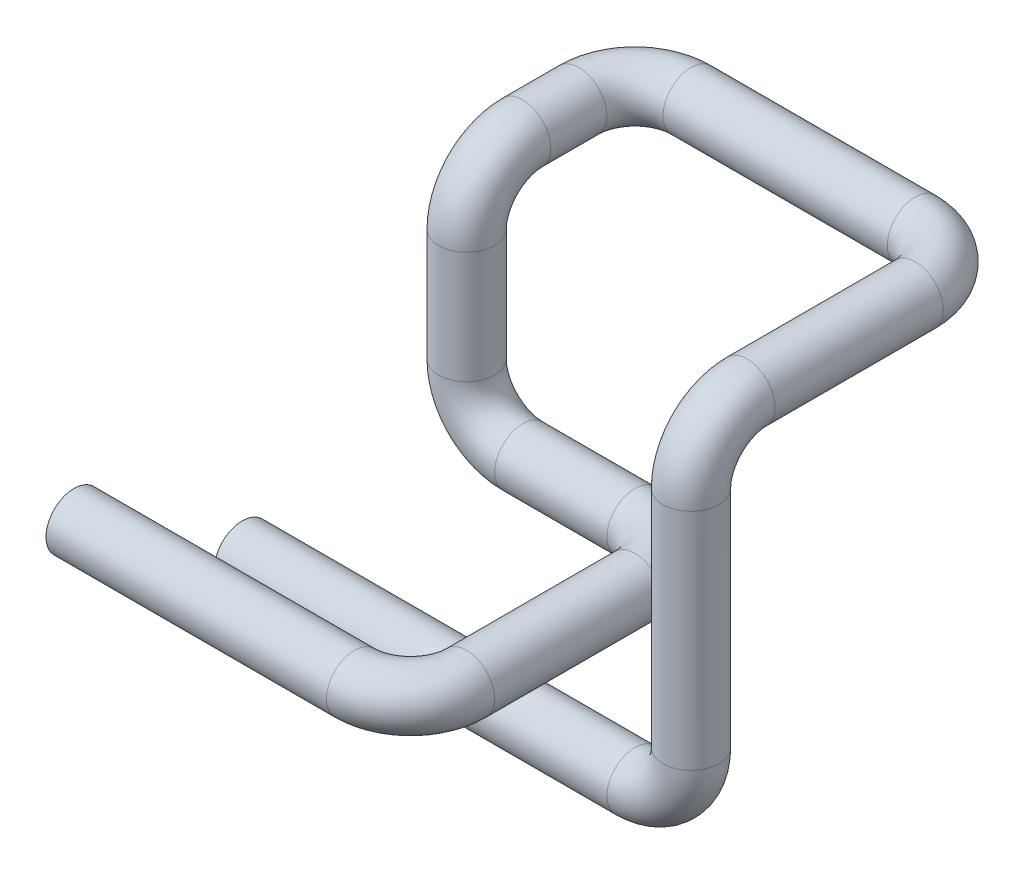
ISO-10303-21;
HEADER;
FILE_DESCRIPTION(('STEP AP214'),'2;1');
FILE_NAME('part.step','',(''),(''),'','','');
FILE_SCHEMA(('AUTOMOTIVE_DESIGN { 1 0 10303 214 1 1 1 1 }'));
ENDSEC;
DATA;
#1=APPLICATION_CONTEXT('core data for automotive mechanical design processes');
#2=APPLICATION_PROTOCOL_DEFINITION('international standard','automotive_design',2000,#1);
#3=PRODUCT_CONTEXT('',#1,'mechanical');
#4=PRODUCT('Part','Part','',(#3));
#5=PRODUCT_RELATED_PRODUCT_CATEGORY('part','',(#4));
#6=PRODUCT_DEFINITION_FORMATION('','',#4);
#7=PRODUCT_DEFINITION_CONTEXT('part definition',#1,'design');
#8=PRODUCT_DEFINITION('design','',#6,#7);
#9=PRODUCT_DEFINITION_SHAPE('','',#8);
#10=(LENGTH_UNIT() NAMED_UNIT(*) SI_UNIT(.MILLI.,.METRE.));
#11=(NAMED_UNIT(*) PLANE_ANGLE_UNIT() SI_UNIT($,.RADIAN.));
#12=(NAMED_UNIT(*) SI_UNIT($,.STERADIAN.) SOLID_ANGLE_UNIT());
#13=UNCERTAINTY_MEASURE_WITH_UNIT(LENGTH_MEASURE(1.E-05),#10,'distance_accuracy_value','');
#14=(GEOMETRIC_REPRESENTATION_CONTEXT(3) GLOBAL_UNCERTAINTY_ASSIGNED_CONTEXT((#13)) GLOBAL_UNIT_ASSIGNED_CONTEXT((#10,
#11,#12)) REPRESENTATION_CONTEXT('',''));
#15=CARTESIAN_POINT('',(0.,0.,0.));
#16=DIRECTION('',(0.,0.,1.));
#17=DIRECTION('',(1.,0.,0.));
#18=AXIS2_PLACEMENT_3D('',#15,#16,#17);
#19=CARTESIAN_POINT('',(0.,0.,0.));
#20=DIRECTION('',(-1.,0.,0.));
#21=DIRECTION('',(0.,0.,1.));
#22=AXIS2_PLACEMENT_3D('',#19,#20,#21);
#23=PLANE('',#22);
#24=CARTESIAN_POINT('',(0.,0.,0.));
#25=DIRECTION('',(-1.,0.,0.));
#26=DIRECTION('',(0.,-1.,0.));
#27=AXIS2_PLACEMENT_3D('',#24,#25,#26);
#28=CIRCLE('',#27,5.08);
#29=CARTESIAN_POINT('',(0.,-5.08,0.));
#30=VERTEX_POINT('',#29);
#31=EDGE_CURVE('E121',#30,#30,#28,.T.);
#32=ORIENTED_EDGE('',*,*,#31,.F.);
#33=EDGE_LOOP('',(#32));
#34=FACE_BOUND('',#33,.T.);
#35=CARTESIAN_POINT('',(0.,0.,0.));
#36=DIRECTION('',(-1.,0.,0.));
#37=DIRECTION('',(0.,0.,1.));
#38=AXIS2_PLACEMENT_3D('',#35,#36,#37);
#39=CIRCLE('',#38,6.35);
#40=CARTESIAN_POINT('',(0.,0.,6.35));
#41=VERTEX_POINT('',#40);
#42=EDGE_CURVE('E114',#41,#41,#39,.T.);
#43=ORIENTED_EDGE('',*,*,#42,.T.);
#44=EDGE_LOOP('',(#43));
#45=FACE_BOUND('',#44,.T.);
#46=ADVANCED_FACE('F56',(#34,#45),#23,.T.);
#47=CARTESIAN_POINT('',(0.,25.4,38.1));
#48=DIRECTION('',(1.,0.,0.));
#49=DIRECTION('',(0.,0.,-1.));
#50=AXIS2_PLACEMENT_3D('',#47,#48,#49);
#51=PLANE('',#50);
#52=CARTESIAN_POINT('',(0.,25.4,38.1));
#53=DIRECTION('',(1.,0.,0.));
#54=DIRECTION('',(0.,0.,-1.));
#55=AXIS2_PLACEMENT_3D('',#52,#53,#54);
#56=CIRCLE('',#55,5.08);
#57=CARTESIAN_POINT('',(0.,25.4,33.02));
#58=VERTEX_POINT('',#57);
#59=EDGE_CURVE('E117',#58,#58,#56,.T.);
#60=ORIENTED_EDGE('',*,*,#59,.T.);
#61=EDGE_LOOP('',(#60));
#62=FACE_BOUND('',#61,.T.);
#63=CARTESIAN_POINT('',(0.,25.4,38.1));
#64=DIRECTION('',(1.,0.,0.));
#65=DIRECTION('',(0.,0.,-1.));
#66=AXIS2_PLACEMENT_3D('',#63,#64,#65);
#67=CIRCLE('',#66,6.35);
#68=CARTESIAN_POINT('',(0.,25.4,31.75));
#69=VERTEX_POINT('',#68);
#70=EDGE_CURVE('E13',#69,#69,#67,.T.);
#71=ORIENTED_EDGE('',*,*,#70,.F.);
#72=EDGE_LOOP('',(#71));
#73=FACE_BOUND('',#72,.T.);
#74=ADVANCED_FACE('F183',(#62,#73),#51,.F.);
#75=CARTESIAN_POINT('',(0.,0.,0.));
#76=DIRECTION('',(1.,0.,0.));
#77=DIRECTION('',(0.,0.,-1.));
#78=AXIS2_PLACEMENT_3D('',#75,#76,#77);
#79=CYLINDRICAL_SURFACE('',#78,6.35);
#80=CARTESIAN_POINT('',(88.9,0.,0.));
#81=DIRECTION('',(-1.,0.,0.));
#82=DIRECTION('',(0.,0.,1.));
#83=AXIS2_PLACEMENT_3D('',#80,#81,#82);
#84=CIRCLE('',#83,6.35);
#85=CARTESIAN_POINT('',(88.9,-6.35000000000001,0.));
#86=VERTEX_POINT('',#85);
#87=EDGE_CURVE('E111',#86,#86,#84,.T.);
#88=ORIENTED_EDGE('',*,*,#87,.T.);
#89=EDGE_LOOP('',(#88));
#90=FACE_BOUND('',#89,.T.);
#91=ORIENTED_EDGE('',*,*,#42,.F.);
#92=EDGE_LOOP('',(#91));
#93=FACE_BOUND('',#92,.T.);
#94=ADVANCED_FACE('F187',(#90,#93),#79,.T.);
#95=CARTESIAN_POINT('',(88.9,12.7,0.));
#96=DIRECTION('',(0.,0.,1.));
#97=DIRECTION('',(1.,0.,0.));
#98=AXIS2_PLACEMENT_3D('',#95,#96,#97);
#99=TOROIDAL_SURFACE('',#98,12.7,6.35);
#100=CARTESIAN_POINT('',(101.6,12.7,0.));
#101=DIRECTION('',(0.,-1.,0.));
#102=DIRECTION('',(0.,0.,1.));
#103=AXIS2_PLACEMENT_3D('',#100,#101,#102);
#104=CIRCLE('',#103,6.35);
#105=CARTESIAN_POINT('',(107.95,12.7,0.));
#106=VERTEX_POINT('',#105);
#107=EDGE_CURVE('E108',#106,#106,#104,.T.);
#108=CARTESIAN_POINT('',(88.9,12.7,0.));
#109=DIRECTION('',(0.,0.,1.));
#110=DIRECTION('',(1.,0.,0.));
#111=AXIS2_PLACEMENT_3D('',#108,#109,#110);
#112=CIRCLE('',#111,19.05);
#113=EDGE_CURVE('',#86,#106,#112,.T.);
#114=ORIENTED_EDGE('',*,*,#87,.F.);
#115=ORIENTED_EDGE('',*,*,#107,.T.);
#116=ORIENTED_EDGE('',*,*,#113,.T.);
#117=ORIENTED_EDGE('',*,*,#113,.F.);
#118=EDGE_LOOP('',(#114,#116,#115,#117));
#119=FACE_BOUND('',#118,.T.);
#120=ADVANCED_FACE('F189',(#119),#99,.T.);
#121=CARTESIAN_POINT('',(101.6,12.7,0.));
#122=DIRECTION('',(0.,1.,0.));
#123=DIRECTION('',(0.,0.,1.));
#124=AXIS2_PLACEMENT_3D('',#121,#122,#123);
#125=CYLINDRICAL_SURFACE('',#124,6.35);
#126=CARTESIAN_POINT('',(101.6,63.5,0.));
#127=DIRECTION('',(0.,-1.,0.));
#128=DIRECTION('',(0.,0.,1.));
#129=AXIS2_PLACEMENT_3D('',#126,#127,#128);
#130=CIRCLE('',#129,6.35);
#131=CARTESIAN_POINT('',(101.6,63.5,6.35));
#132=VERTEX_POINT('',#131);
#133=EDGE_CURVE('E105',#132,#132,#130,.T.);
#134=ORIENTED_EDGE('',*,*,#133,.T.);
#135=EDGE_LOOP('',(#134));
#136=FACE_BOUND('',#135,.T.);
#137=ORIENTED_EDGE('',*,*,#107,.F.);
#138=EDGE_LOOP('',(#137));
#139=FACE_BOUND('',#138,.T.);
#140=ADVANCED_FACE('F196',(#136,#139),#125,.T.);
#141=CARTESIAN_POINT('',(101.6,63.5,-12.7));
#142=DIRECTION('',(-1.,0.,0.));
#143=DIRECTION('',(0.,0.,1.));
#144=AXIS2_PLACEMENT_3D('',#141,#142,#143);
#145=TOROIDAL_SURFACE('',#144,12.7,6.35);
#146=CARTESIAN_POINT('',(101.6,76.2,-12.7));
#147=DIRECTION('',(0.,0.,1.));
#148=DIRECTION('',(0.,1.,0.));
#149=AXIS2_PLACEMENT_3D('',#146,#147,#148);
#150=CIRCLE('',#149,6.35);
#151=CARTESIAN_POINT('',(101.6,82.55,-12.7));
#152=VERTEX_POINT('',#151);
#153=EDGE_CURVE('E102',#152,#152,#150,.T.);
#154=CARTESIAN_POINT('',(101.6,63.5,-12.7));
#155=DIRECTION('',(-1.,0.,0.));
#156=DIRECTION('',(0.,0.,1.));
#157=AXIS2_PLACEMENT_3D('',#154,#155,#156);
#158=CIRCLE('',#157,19.05);
#159=EDGE_CURVE('',#132,#152,#158,.T.);
#160=ORIENTED_EDGE('',*,*,#133,.F.);
#161=ORIENTED_EDGE('',*,*,#153,.T.);
#162=ORIENTED_EDGE('',*,*,#159,.T.);
#163=ORIENTED_EDGE('',*,*,#159,.F.);
#164=EDGE_LOOP('',(#160,#162,#161,#163));
#165=FACE_BOUND('',#164,.T.);
#166=ADVANCED_FACE('F253',(#165),#145,.T.);
#167=CARTESIAN_POINT('',(101.6,76.2,-12.7));
#168=DIRECTION('',(0.,0.,-1.));
#169=DIRECTION('',(-1.,0.,0.));
#170=AXIS2_PLACEMENT_3D('',#167,#168,#169);
#171=CYLINDRICAL_SURFACE('',#170,6.35);
#172=CARTESIAN_POINT('',(101.6,76.2,-50.8));
#173=DIRECTION('',(0.,0.,1.));
#174=DIRECTION('',(0.,1.,0.));
#175=AXIS2_PLACEMENT_3D('',#172,#173,#174);
#176=CIRCLE('',#175,6.35);
#177=CARTESIAN_POINT('',(107.95,76.2,-50.8));
#178=VERTEX_POINT('',#177);
#179=EDGE_CURVE('E99',#178,#178,#176,.T.);
#180=ORIENTED_EDGE('',*,*,#179,.T.);
#181=EDGE_LOOP('',(#180));
#182=FACE_BOUND('',#181,.T.);
#183=ORIENTED_EDGE('',*,*,#153,.F.);
#184=EDGE_LOOP('',(#183));
#185=FACE_BOUND('',#184,.T.);
#186=ADVANCED_FACE('F249',(#182,#185),#171,.T.);
#187=CARTESIAN_POINT('',(88.9,76.2,-50.8));
#188=DIRECTION('',(0.,1.,0.));
#189=DIRECTION('',(0.,0.,1.));
#190=AXIS2_PLACEMENT_3D('',#187,#188,#189);
#191=TOROIDAL_SURFACE('',#190,12.7,6.35);
#192=CARTESIAN_POINT('',(88.9,76.2,-63.5));
#193=DIRECTION('',(1.,0.,0.));
#194=DIRECTION('',(0.,1.,0.));
#195=AXIS2_PLACEMENT_3D('',#192,#193,#194);
#196=CIRCLE('',#195,6.35);
#197=CARTESIAN_POINT('',(88.9,76.2,-69.85));
#198=VERTEX_POINT('',#197);
#199=EDGE_CURVE('E96',#198,#198,#196,.T.);
#200=CARTESIAN_POINT('',(88.9,76.2,-50.8));
#201=DIRECTION('',(0.,1.,0.));
#202=DIRECTION('',(0.,0.,1.));
#203=AXIS2_PLACEMENT_3D('',#200,#201,#202);
#204=CIRCLE('',#203,19.05);
#205=EDGE_CURVE('',#178,#198,#204,.T.);
#206=ORIENTED_EDGE('',*,*,#179,.F.);
#207=ORIENTED_EDGE('',*,*,#199,.T.);
#208=ORIENTED_EDGE('',*,*,#205,.T.);
#209=ORIENTED_EDGE('',*,*,#205,.F.);
#210=EDGE_LOOP('',(#206,#208,#207,#209));
#211=FACE_BOUND('',#210,.T.);
#212=ADVANCED_FACE('F245',(#211),#191,.T.);
#213=CARTESIAN_POINT('',(88.9,76.2,-63.5));
#214=DIRECTION('',(-1.,0.,0.));
#215=DIRECTION('',(0.,0.,1.));
#216=AXIS2_PLACEMENT_3D('',#213,#214,#215);
#217=CYLINDRICAL_SURFACE('',#216,6.35);
#218=CARTESIAN_POINT('',(38.1,76.2,-63.5));
#219=DIRECTION('',(1.,0.,0.));
#220=DIRECTION('',(0.,1.,0.));
#221=AXIS2_PLACEMENT_3D('',#218,#219,#220);
#222=CIRCLE('',#221,6.35);
#223=CARTESIAN_POINT('',(38.1,76.2,-69.85));
#224=VERTEX_POINT('',#223);
#225=EDGE_CURVE('E93',#224,#224,#222,.T.);
#226=ORIENTED_EDGE('',*,*,#225,.T.);
#227=EDGE_LOOP('',(#226));
#228=FACE_BOUND('',#227,.T.);
#229=ORIENTED_EDGE('',*,*,#199,.F.);
#230=EDGE_LOOP('',(#229));
#231=FACE_BOUND('',#230,.T.);
#232=ADVANCED_FACE('F241',(#228,#231),#217,.T.);
#233=CARTESIAN_POINT('',(38.1,76.2,-50.8));
#234=DIRECTION('',(0.,1.,0.));
#235=DIRECTION('',(0.,0.,1.));
#236=AXIS2_PLACEMENT_3D('',#233,#234,#235);
#237=TOROIDAL_SURFACE('',#236,12.7,6.35);
#238=CARTESIAN_POINT('',(25.4,76.2,-50.8));
#239=DIRECTION('',(0.,0.,-1.));
#240=DIRECTION('',(0.,1.,0.));
#241=AXIS2_PLACEMENT_3D('',#238,#239,#240);
#242=CIRCLE('',#241,6.35);
#243=CARTESIAN_POINT('',(19.05,76.2,-50.8));
#244=VERTEX_POINT('',#243);
#245=EDGE_CURVE('E90',#244,#244,#242,.T.);
#246=CARTESIAN_POINT('',(38.1,76.2,-50.8));
#247=DIRECTION('',(0.,1.,0.));
#248=DIRECTION('',(0.,0.,1.));
#249=AXIS2_PLACEMENT_3D('',#246,#247,#248);
#250=CIRCLE('',#249,19.05);
#251=EDGE_CURVE('',#224,#244,#250,.T.);
#252=ORIENTED_EDGE('',*,*,#225,.F.);
#253=ORIENTED_EDGE('',*,*,#245,.T.);
#254=ORIENTED_EDGE('',*,*,#251,.T.);
#255=ORIENTED_EDGE('',*,*,#251,.F.);
#256=EDGE_LOOP('',(#252,#254,#253,#255));
#257=FACE_BOUND('',#256,.T.);
#258=ADVANCED_FACE('F237',(#257),#237,.T.);
#259=CARTESIAN_POINT('',(25.4,76.2,-50.8));
#260=DIRECTION('',(0.,0.,1.));
#261=DIRECTION('',(1.,0.,0.));
#262=AXIS2_PLACEMENT_3D('',#259,#260,#261);
#263=CYLINDRICAL_SURFACE('',#262,6.35);
#264=CARTESIAN_POINT('',(25.4,76.2,-38.1));
#265=DIRECTION('',(0.,0.,-1.));
#266=DIRECTION('',(0.,1.,0.));
#267=AXIS2_PLACEMENT_3D('',#264,#265,#266);
#268=CIRCLE('',#267,6.35);
#269=CARTESIAN_POINT('',(25.4,82.55,-38.1));
#270=VERTEX_POINT('',#269);
#271=EDGE_CURVE('E87',#270,#270,#268,.T.);
#272=ORIENTED_EDGE('',*,*,#271,.T.);
#273=EDGE_LOOP('',(#272));
#274=FACE_BOUND('',#273,.T.);
#275=ORIENTED_EDGE('',*,*,#245,.F.);
#276=EDGE_LOOP('',(#275));
#277=FACE_BOUND('',#276,.T.);
#278=ADVANCED_FACE('F233',(#274,#277),#263,.T.);
#279=CARTESIAN_POINT('',(25.4,63.5,-38.1));
#280=DIRECTION('',(1.,0.,0.));
#281=DIRECTION('',(0.,0.,-1.));
#282=AXIS2_PLACEMENT_3D('',#279,#280,#281);
#283=TOROIDAL_SURFACE('',#282,12.7,6.35);
#284=CARTESIAN_POINT('',(25.4,63.5,-25.4));
#285=DIRECTION('',(0.,1.,0.));
#286=DIRECTION('',(0.,0.,1.));
#287=AXIS2_PLACEMENT_3D('',#284,#285,#286);
#288=CIRCLE('',#287,6.35);
#289=CARTESIAN_POINT('',(25.4,63.5,-19.05));
#290=VERTEX_POINT('',#289);
#291=EDGE_CURVE('E84',#290,#290,#288,.T.);
#292=CARTESIAN_POINT('',(25.4,63.5,-38.1));
#293=DIRECTION('',(1.,0.,0.));
#294=DIRECTION('',(0.,0.,-1.));
#295=AXIS2_PLACEMENT_3D('',#292,#293,#294);
#296=CIRCLE('',#295,19.05);
#297=EDGE_CURVE('',#270,#290,#296,.T.);
#298=ORIENTED_EDGE('',*,*,#271,.F.);
#299=ORIENTED_EDGE('',*,*,#291,.T.);
#300=ORIENTED_EDGE('',*,*,#297,.T.);
#301=ORIENTED_EDGE('',*,*,#297,.F.);
#302=EDGE_LOOP('',(#298,#300,#299,#301));
#303=FACE_BOUND('',#302,.T.);
#304=ADVANCED_FACE('F229',(#303),#283,.T.);
#305=CARTESIAN_POINT('',(25.4,63.5,-25.4));
#306=DIRECTION('',(0.,-1.,0.));
#307=DIRECTION('',(1.,0.,0.));
#308=AXIS2_PLACEMENT_3D('',#305,#306,#307);
#309=CYLINDRICAL_SURFACE('',#308,6.35);
#310=CARTESIAN_POINT('',(25.4,38.1,-25.4));
#311=DIRECTION('',(0.,1.,0.));
#312=DIRECTION('',(0.,0.,1.));
#313=AXIS2_PLACEMENT_3D('',#310,#311,#312);
#314=CIRCLE('',#313,6.35);
#315=CARTESIAN_POINT('',(19.05,38.1,-25.4));
#316=VERTEX_POINT('',#315);
#317=EDGE_CURVE('E81',#316,#316,#314,.T.);
#318=ORIENTED_EDGE('',*,*,#317,.T.);
#319=EDGE_LOOP('',(#318));
#320=FACE_BOUND('',#319,.T.);
#321=ORIENTED_EDGE('',*,*,#291,.F.);
#322=EDGE_LOOP('',(#321));
#323=FACE_BOUND('',#322,.T.);
#324=ADVANCED_FACE('F225',(#320,#323),#309,.T.);
#325=CARTESIAN_POINT('',(38.1,38.1,-25.4));
#326=DIRECTION('',(0.,0.,1.));
#327=DIRECTION('',(1.,0.,0.));
#328=AXIS2_PLACEMENT_3D('',#325,#326,#327);
#329=TOROIDAL_SURFACE('',#328,12.7,6.35);
#330=CARTESIAN_POINT('',(38.1,25.4,-25.4));
#331=DIRECTION('',(-1.,0.,0.));
#332=DIRECTION('',(0.,0.,1.));
#333=AXIS2_PLACEMENT_3D('',#330,#331,#332);
#334=CIRCLE('',#333,6.35);
#335=CARTESIAN_POINT('',(38.1,19.05,-25.4));
#336=VERTEX_POINT('',#335);
#337=EDGE_CURVE('E78',#336,#336,#334,.T.);
#338=CARTESIAN_POINT('',(38.1,38.1,-25.4));
#339=DIRECTION('',(0.,0.,1.));
#340=DIRECTION('',(1.,0.,0.));
#341=AXIS2_PLACEMENT_3D('',#338,#339,#340);
#342=CIRCLE('',#341,19.05);
#343=EDGE_CURVE('',#316,#336,#342,.T.);
#344=ORIENTED_EDGE('',*,*,#317,.F.);
#345=ORIENTED_EDGE('',*,*,#337,.T.);
#346=ORIENTED_EDGE('',*,*,#343,.T.);
#347=ORIENTED_EDGE('',*,*,#343,.F.);
#348=EDGE_LOOP('',(#344,#346,#345,#347));
#349=FACE_BOUND('',#348,.T.);
#350=ADVANCED_FACE('F221',(#349),#329,.T.);
#351=CARTESIAN_POINT('',(38.1,25.4,-25.4));
#352=DIRECTION('',(1.,0.,0.));
#353=DIRECTION('',(0.,0.,-1.));
#354=AXIS2_PLACEMENT_3D('',#351,#352,#353);
#355=CYLINDRICAL_SURFACE('',#354,6.35);
#356=CARTESIAN_POINT('',(63.5,25.4,-25.4));
#357=DIRECTION('',(-1.,0.,0.));
#358=DIRECTION('',(0.,0.,1.));
#359=AXIS2_PLACEMENT_3D('',#356,#357,#358);
#360=CIRCLE('',#359,6.35);
#361=CARTESIAN_POINT('',(63.5,25.4,-31.75));
#362=VERTEX_POINT('',#361);
#363=EDGE_CURVE('E75',#362,#362,#360,.T.);
#364=ORIENTED_EDGE('',*,*,#363,.T.);
#365=EDGE_LOOP('',(#364));
#366=FACE_BOUND('',#365,.T.);
#367=ORIENTED_EDGE('',*,*,#337,.F.);
#368=EDGE_LOOP('',(#367));
#369=FACE_BOUND('',#368,.T.);
#370=ADVANCED_FACE('F217',(#366,#369),#355,.T.);
#371=CARTESIAN_POINT('',(63.5,25.4,-12.7));
#372=DIRECTION('',(0.,-1.,0.));
#373=DIRECTION('',(0.,0.,-1.));
#374=AXIS2_PLACEMENT_3D('',#371,#372,#373);
#375=TOROIDAL_SURFACE('',#374,12.7,6.35);
#376=CARTESIAN_POINT('',(76.2,25.4,-12.7));
#377=DIRECTION('',(0.,0.,-1.));
#378=DIRECTION('',(-1.,0.,0.));
#379=AXIS2_PLACEMENT_3D('',#376,#377,#378);
#380=CIRCLE('',#379,6.35);
#381=CARTESIAN_POINT('',(82.55,25.4,-12.7));
#382=VERTEX_POINT('',#381);
#383=EDGE_CURVE('E70',#382,#382,#380,.T.);
#384=CARTESIAN_POINT('',(63.5,25.4,-12.7));
#385=DIRECTION('',(0.,-1.,0.));
#386=DIRECTION('',(0.,0.,-1.));
#387=AXIS2_PLACEMENT_3D('',#384,#385,#386);
#388=CIRCLE('',#387,19.05);
#389=EDGE_CURVE('',#362,#382,#388,.T.);
#390=ORIENTED_EDGE('',*,*,#363,.F.);
#391=ORIENTED_EDGE('',*,*,#383,.T.);
#392=ORIENTED_EDGE('',*,*,#389,.T.);
#393=ORIENTED_EDGE('',*,*,#389,.F.);
#394=EDGE_LOOP('',(#390,#392,#391,#393));
#395=FACE_BOUND('',#394,.T.);
#396=ADVANCED_FACE('F213',(#395),#375,.T.);
#397=CARTESIAN_POINT('',(76.2,25.4,-12.7));
#398=DIRECTION('',(0.,0.,1.));
#399=DIRECTION('',(1.,0.,0.));
#400=AXIS2_PLACEMENT_3D('',#397,#398,#399);
#401=CYLINDRICAL_SURFACE('',#400,6.35);
#402=CARTESIAN_POINT('',(76.2,25.4,25.4));
#403=DIRECTION('',(0.,0.,-1.));
#404=DIRECTION('',(-1.,0.,0.));
#405=AXIS2_PLACEMENT_3D('',#402,#403,#404);
#406=CIRCLE('',#405,6.35);
#407=CARTESIAN_POINT('',(82.55,25.4,25.4));
#408=VERTEX_POINT('',#407);
#409=EDGE_CURVE('E66',#408,#408,#406,.T.);
#410=ORIENTED_EDGE('',*,*,#409,.T.);
#411=EDGE_LOOP('',(#410));
#412=FACE_BOUND('',#411,.T.);
#413=ORIENTED_EDGE('',*,*,#383,.F.);
#414=EDGE_LOOP('',(#413));
#415=FACE_BOUND('',#414,.T.);
#416=ADVANCED_FACE('F207',(#412,#415),#401,.T.);
#417=CARTESIAN_POINT('',(63.5,25.4,25.4));
#418=DIRECTION('',(0.,-1.,0.));
#419=DIRECTION('',(0.,0.,-1.));
#420=AXIS2_PLACEMENT_3D('',#417,#418,#419);
#421=TOROIDAL_SURFACE('',#420,12.7,6.35);
#422=CARTESIAN_POINT('',(63.5,25.4,38.1));
#423=DIRECTION('',(1.,0.,0.));
#424=DIRECTION('',(0.,0.,-1.));
#425=AXIS2_PLACEMENT_3D('',#422,#423,#424);
#426=CIRCLE('',#425,6.35);
#427=CARTESIAN_POINT('',(63.5,25.4,44.45));
#428=VERTEX_POINT('',#427);
#429=EDGE_CURVE('E62',#428,#428,#426,.T.);
#430=CARTESIAN_POINT('',(63.5,25.4,25.4));
#431=DIRECTION('',(0.,-1.,0.));
#432=DIRECTION('',(0.,0.,-1.));
#433=AXIS2_PLACEMENT_3D('',#430,#431,#432);
#434=CIRCLE('',#433,19.05);
#435=EDGE_CURVE('',#408,#428,#434,.T.);
#436=ORIENTED_EDGE('',*,*,#409,.F.);
#437=ORIENTED_EDGE('',*,*,#429,.T.);
#438=ORIENTED_EDGE('',*,*,#435,.T.);
#439=ORIENTED_EDGE('',*,*,#435,.F.);
#440=EDGE_LOOP('',(#436,#438,#437,#439));
#441=FACE_BOUND('',#440,.T.);
#442=ADVANCED_FACE('F202',(#441),#421,.T.);
#443=CARTESIAN_POINT('',(63.5,25.4,38.1));
#444=DIRECTION('',(-1.,0.,0.));
#445=DIRECTION('',(0.,-1.,0.));
#446=AXIS2_PLACEMENT_3D('',#443,#444,#445);
#447=CYLINDRICAL_SURFACE('',#446,6.35);
#448=ORIENTED_EDGE('',*,*,#70,.T.);
#449=EDGE_LOOP('',(#448));
#450=FACE_BOUND('',#449,.T.);
#451=ORIENTED_EDGE('',*,*,#429,.F.);
#452=EDGE_LOOP('',(#451));
#453=FACE_BOUND('',#452,.T.);
#454=ADVANCED_FACE('F177',(#450,#453),#447,.T.);
#455=CARTESIAN_POINT('',(0.,0.,0.));
#456=DIRECTION('',(1.,0.,0.));
#457=DIRECTION('',(0.,0.,-1.));
#458=AXIS2_PLACEMENT_3D('',#455,#456,#457);
#459=CYLINDRICAL_SURFACE('',#458,5.08);
#460=CARTESIAN_POINT('',(88.9,0.,0.));
#461=DIRECTION('',(1.,0.,0.));
#462=DIRECTION('',(0.,0.,-1.));
#463=AXIS2_PLACEMENT_3D('',#460,#461,#462);
#464=CIRCLE('',#463,5.08);
#465=CARTESIAN_POINT('',(88.9,-5.08000000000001,0.));
#466=VERTEX_POINT('',#465);
#467=EDGE_CURVE('E124',#466,#466,#464,.F.);
#468=ORIENTED_EDGE('',*,*,#467,.F.);
#469=EDGE_LOOP('',(#468));
#470=FACE_BOUND('',#469,.T.);
#471=ORIENTED_EDGE('',*,*,#31,.T.);
#472=EDGE_LOOP('',(#471));
#473=FACE_BOUND('',#472,.T.);
#474=ADVANCED_FACE('F174',(#470,#473),#459,.F.);
#475=CARTESIAN_POINT('',(88.9,12.7,0.));
#476=DIRECTION('',(0.,0.,1.));
#477=DIRECTION('',(1.,0.,0.));
#478=AXIS2_PLACEMENT_3D('',#475,#476,#477);
#479=TOROIDAL_SURFACE('',#478,12.7,5.08);
#480=CARTESIAN_POINT('',(101.6,12.7,0.));
#481=DIRECTION('',(0.,-1.,0.));
#482=DIRECTION('',(0.,0.,-1.));
#483=AXIS2_PLACEMENT_3D('',#480,#481,#482);
#484=CIRCLE('',#483,5.08);
#485=CARTESIAN_POINT('',(106.68,12.7,0.));
#486=VERTEX_POINT('',#485);
#487=EDGE_CURVE('E166',#486,#486,#484,.T.);
#488=CARTESIAN_POINT('',(88.9,12.7,0.));
#489=DIRECTION('',(0.,0.,1.));
#490=DIRECTION('',(1.,0.,0.));
#491=AXIS2_PLACEMENT_3D('',#488,#489,#490);
#492=CIRCLE('',#491,17.78);
#493=EDGE_CURVE('',#466,#486,#492,.T.);
#494=ORIENTED_EDGE('',*,*,#467,.T.);
#495=ORIENTED_EDGE('',*,*,#487,.F.);
#496=ORIENTED_EDGE('',*,*,#493,.T.);
#497=ORIENTED_EDGE('',*,*,#493,.F.);
#498=EDGE_LOOP('',(#494,#496,#495,#497));
#499=FACE_BOUND('',#498,.T.);
#500=ADVANCED_FACE('F172',(#499),#479,.F.);
#501=CARTESIAN_POINT('',(101.6,12.7,0.));
#502=DIRECTION('',(0.,1.,0.));
#503=DIRECTION('',(0.,0.,1.));
#504=AXIS2_PLACEMENT_3D('',#501,#502,#503);
#505=CYLINDRICAL_SURFACE('',#504,5.08);
#506=CARTESIAN_POINT('',(101.6,63.5,0.));
#507=DIRECTION('',(0.,1.,0.));
#508=DIRECTION('',(0.,0.,1.));
#509=AXIS2_PLACEMENT_3D('',#506,#507,#508);
#510=CIRCLE('',#509,5.08);
#511=CARTESIAN_POINT('',(101.6,63.5,5.08));
#512=VERTEX_POINT('',#511);
#513=EDGE_CURVE('E163',#512,#512,#510,.F.);
#514=ORIENTED_EDGE('',*,*,#513,.F.);
#515=EDGE_LOOP('',(#514));
#516=FACE_BOUND('',#515,.T.);
#517=ORIENTED_EDGE('',*,*,#487,.T.);
#518=EDGE_LOOP('',(#517));
#519=FACE_BOUND('',#518,.T.);
#520=ADVANCED_FACE('F341',(#516,#519),#505,.F.);
#521=CARTESIAN_POINT('',(101.6,63.5,-12.7));
#522=DIRECTION('',(-1.,0.,0.));
#523=DIRECTION('',(0.,0.,1.));
#524=AXIS2_PLACEMENT_3D('',#521,#522,#523);
#525=TOROIDAL_SURFACE('',#524,12.7,5.08);
#526=CARTESIAN_POINT('',(101.6,76.2,-12.7));
#527=DIRECTION('',(0.,0.,1.));
#528=DIRECTION('',(0.,-1.,0.));
#529=AXIS2_PLACEMENT_3D('',#526,#527,#528);
#530=CIRCLE('',#529,5.08);
#531=CARTESIAN_POINT('',(101.6,81.28,-12.7));
#532=VERTEX_POINT('',#531);
#533=EDGE_CURVE('E160',#532,#532,#530,.T.);
#534=CARTESIAN_POINT('',(101.6,63.5,-12.7));
#535=DIRECTION('',(-1.,0.,0.));
#536=DIRECTION('',(0.,0.,1.));
#537=AXIS2_PLACEMENT_3D('',#534,#535,#536);
#538=CIRCLE('',#537,17.78);
#539=EDGE_CURVE('',#512,#532,#538,.T.);
#540=ORIENTED_EDGE('',*,*,#513,.T.);
#541=ORIENTED_EDGE('',*,*,#533,.F.);
#542=ORIENTED_EDGE('',*,*,#539,.T.);
#543=ORIENTED_EDGE('',*,*,#539,.F.);
#544=EDGE_LOOP('',(#540,#542,#541,#543));
#545=FACE_BOUND('',#544,.T.);
#546=ADVANCED_FACE('F351',(#545),#525,.F.);
#547=CARTESIAN_POINT('',(101.6,76.2,-12.7));
#548=DIRECTION('',(0.,0.,-1.));
#549=DIRECTION('',(-1.,0.,0.));
#550=AXIS2_PLACEMENT_3D('',#547,#548,#549);
#551=CYLINDRICAL_SURFACE('',#550,5.08);
#552=CARTESIAN_POINT('',(101.6,76.2,-50.8));
#553=DIRECTION('',(0.,0.,-1.));
#554=DIRECTION('',(-1.,0.,0.));
#555=AXIS2_PLACEMENT_3D('',#552,#553,#554);
#556=CIRCLE('',#555,5.08);
#557=CARTESIAN_POINT('',(106.68,76.2,-50.8));
#558=VERTEX_POINT('',#557);
#559=EDGE_CURVE('E157',#558,#558,#556,.F.);
#560=ORIENTED_EDGE('',*,*,#559,.F.);
#561=EDGE_LOOP('',(#560));
#562=FACE_BOUND('',#561,.T.);
#563=ORIENTED_EDGE('',*,*,#533,.T.);
#564=EDGE_LOOP('',(#563));
#565=FACE_BOUND('',#564,.T.);
#566=ADVANCED_FACE('F361',(#562,#565),#551,.F.);
#567=CARTESIAN_POINT('',(88.9,76.2,-50.8));
#568=DIRECTION('',(0.,1.,0.));
#569=DIRECTION('',(0.,0.,1.));
#570=AXIS2_PLACEMENT_3D('',#567,#568,#569);
#571=TOROIDAL_SURFACE('',#570,12.7,5.08);
#572=CARTESIAN_POINT('',(88.9,76.2,-63.5));
#573=DIRECTION('',(1.,0.,0.));
#574=DIRECTION('',(0.,0.,-1.));
#575=AXIS2_PLACEMENT_3D('',#572,#573,#574);
#576=CIRCLE('',#575,5.08);
#577=CARTESIAN_POINT('',(88.9,76.2,-68.58));
#578=VERTEX_POINT('',#577);
#579=EDGE_CURVE('E154',#578,#578,#576,.T.);
#580=CARTESIAN_POINT('',(88.9,76.2,-50.8));
#581=DIRECTION('',(0.,1.,0.));
#582=DIRECTION('',(0.,0.,1.));
#583=AXIS2_PLACEMENT_3D('',#580,#581,#582);
#584=CIRCLE('',#583,17.78);
#585=EDGE_CURVE('',#558,#578,#584,.T.);
#586=ORIENTED_EDGE('',*,*,#559,.T.);
#587=ORIENTED_EDGE('',*,*,#579,.F.);
#588=ORIENTED_EDGE('',*,*,#585,.T.);
#589=ORIENTED_EDGE('',*,*,#585,.F.);
#590=EDGE_LOOP('',(#586,#588,#587,#589));
#591=FACE_BOUND('',#590,.T.);
#592=ADVANCED_FACE('F371',(#591),#571,.F.);
#593=CARTESIAN_POINT('',(88.9,76.2,-63.5));
#594=DIRECTION('',(-1.,0.,0.));
#595=DIRECTION('',(0.,0.,1.));
#596=AXIS2_PLACEMENT_3D('',#593,#594,#595);
#597=CYLINDRICAL_SURFACE('',#596,5.08);
#598=CARTESIAN_POINT('',(38.1,76.2,-63.5));
#599=DIRECTION('',(-1.,0.,0.));
#600=DIRECTION('',(0.,0.,1.));
#601=AXIS2_PLACEMENT_3D('',#598,#599,#600);
#602=CIRCLE('',#601,5.08);
#603=CARTESIAN_POINT('',(38.1,76.2,-68.58));
#604=VERTEX_POINT('',#603);
#605=EDGE_CURVE('E151',#604,#604,#602,.F.);
#606=ORIENTED_EDGE('',*,*,#605,.F.);
#607=EDGE_LOOP('',(#606));
#608=FACE_BOUND('',#607,.T.);
#609=ORIENTED_EDGE('',*,*,#579,.T.);
#610=EDGE_LOOP('',(#609));
#611=FACE_BOUND('',#610,.T.);
#612=ADVANCED_FACE('F381',(#608,#611),#597,.F.);
#613=CARTESIAN_POINT('',(38.1,76.2,-50.8));
#614=DIRECTION('',(0.,1.,0.));
#615=DIRECTION('',(0.,0.,1.));
#616=AXIS2_PLACEMENT_3D('',#613,#614,#615);
#617=TOROIDAL_SURFACE('',#616,12.7,5.08);
#618=CARTESIAN_POINT('',(25.4,76.2,-50.8));
#619=DIRECTION('',(0.,0.,-1.));
#620=DIRECTION('',(-1.,0.,0.));
#621=AXIS2_PLACEMENT_3D('',#618,#619,#620);
#622=CIRCLE('',#621,5.08);
#623=CARTESIAN_POINT('',(20.32,76.2,-50.8));
#624=VERTEX_POINT('',#623);
#625=EDGE_CURVE('E148',#624,#624,#622,.T.);
#626=CARTESIAN_POINT('',(38.1,76.2,-50.8));
#627=DIRECTION('',(0.,1.,0.));
#628=DIRECTION('',(0.,0.,1.));
#629=AXIS2_PLACEMENT_3D('',#626,#627,#628);
#630=CIRCLE('',#629,17.78);
#631=EDGE_CURVE('',#604,#624,#630,.T.);
#632=ORIENTED_EDGE('',*,*,#605,.T.);
#633=ORIENTED_EDGE('',*,*,#625,.F.);
#634=ORIENTED_EDGE('',*,*,#631,.T.);
#635=ORIENTED_EDGE('',*,*,#631,.F.);
#636=EDGE_LOOP('',(#632,#634,#633,#635));
#637=FACE_BOUND('',#636,.T.);
#638=ADVANCED_FACE('F391',(#637),#617,.F.);
#639=CARTESIAN_POINT('',(25.4,76.2,-50.8));
#640=DIRECTION('',(0.,0.,1.));
#641=DIRECTION('',(1.,0.,0.));
#642=AXIS2_PLACEMENT_3D('',#639,#640,#641);
#643=CYLINDRICAL_SURFACE('',#642,5.08);
#644=CARTESIAN_POINT('',(25.4,76.2,-38.1));
#645=DIRECTION('',(0.,0.,1.));
#646=DIRECTION('',(1.,0.,0.));
#647=AXIS2_PLACEMENT_3D('',#644,#645,#646);
#648=CIRCLE('',#647,5.08);
#649=CARTESIAN_POINT('',(25.4,81.28,-38.1));
#650=VERTEX_POINT('',#649);
#651=EDGE_CURVE('E145',#650,#650,#648,.F.);
#652=ORIENTED_EDGE('',*,*,#651,.F.);
#653=EDGE_LOOP('',(#652));
#654=FACE_BOUND('',#653,.T.);
#655=ORIENTED_EDGE('',*,*,#625,.T.);
#656=EDGE_LOOP('',(#655));
#657=FACE_BOUND('',#656,.T.);
#658=ADVANCED_FACE('F401',(#654,#657),#643,.F.);
#659=CARTESIAN_POINT('',(25.4,63.5,-38.1));
#660=DIRECTION('',(1.,0.,0.));
#661=DIRECTION('',(0.,0.,-1.));
#662=AXIS2_PLACEMENT_3D('',#659,#660,#661);
#663=TOROIDAL_SURFACE('',#662,12.7,5.08);
#664=CARTESIAN_POINT('',(25.4,63.5,-25.4));
#665=DIRECTION('',(0.,1.,0.));
#666=DIRECTION('',(0.,0.,1.));
#667=AXIS2_PLACEMENT_3D('',#664,#665,#666);
#668=CIRCLE('',#667,5.08);
#669=CARTESIAN_POINT('',(25.4,63.5,-20.32));
#670=VERTEX_POINT('',#669);
#671=EDGE_CURVE('E142',#670,#670,#668,.T.);
#672=CARTESIAN_POINT('',(25.4,63.5,-38.1));
#673=DIRECTION('',(1.,0.,0.));
#674=DIRECTION('',(0.,0.,-1.));
#675=AXIS2_PLACEMENT_3D('',#672,#673,#674);
#676=CIRCLE('',#675,17.78);
#677=EDGE_CURVE('',#650,#670,#676,.T.);
#678=ORIENTED_EDGE('',*,*,#651,.T.);
#679=ORIENTED_EDGE('',*,*,#671,.F.);
#680=ORIENTED_EDGE('',*,*,#677,.T.);
#681=ORIENTED_EDGE('',*,*,#677,.F.);
#682=EDGE_LOOP('',(#678,#680,#679,#681));
#683=FACE_BOUND('',#682,.T.);
#684=ADVANCED_FACE('F411',(#683),#663,.F.);
#685=CARTESIAN_POINT('',(25.4,63.5,-25.4));
#686=DIRECTION('',(0.,-1.,0.));
#687=DIRECTION('',(1.,0.,0.));
#688=AXIS2_PLACEMENT_3D('',#685,#686,#687);
#689=CYLINDRICAL_SURFACE('',#688,5.08);
#690=CARTESIAN_POINT('',(25.4,38.1,-25.4));
#691=DIRECTION('',(0.,-1.,0.));
#692=DIRECTION('',(1.,0.,0.));
#693=AXIS2_PLACEMENT_3D('',#690,#691,#692);
#694=CIRCLE('',#693,5.08);
#695=CARTESIAN_POINT('',(20.32,38.1,-25.4));
#696=VERTEX_POINT('',#695);
#697=EDGE_CURVE('E139',#696,#696,#694,.F.);
#698=ORIENTED_EDGE('',*,*,#697,.F.);
#699=EDGE_LOOP('',(#698));
#700=FACE_BOUND('',#699,.T.);
#701=ORIENTED_EDGE('',*,*,#671,.T.);
#702=EDGE_LOOP('',(#701));
#703=FACE_BOUND('',#702,.T.);
#704=ADVANCED_FACE('F421',(#700,#703),#689,.F.);
#705=CARTESIAN_POINT('',(38.1,38.1,-25.4));
#706=DIRECTION('',(0.,0.,1.));
#707=DIRECTION('',(1.,0.,0.));
#708=AXIS2_PLACEMENT_3D('',#705,#706,#707);
#709=TOROIDAL_SURFACE('',#708,12.7,5.08);
#710=CARTESIAN_POINT('',(38.1,25.4,-25.4));
#711=DIRECTION('',(-1.,0.,0.));
#712=DIRECTION('',(0.,0.,1.));
#713=AXIS2_PLACEMENT_3D('',#710,#711,#712);
#714=CIRCLE('',#713,5.08);
#715=CARTESIAN_POINT('',(38.1,20.32,-25.4));
#716=VERTEX_POINT('',#715);
#717=EDGE_CURVE('E136',#716,#716,#714,.T.);
#718=CARTESIAN_POINT('',(38.1,38.1,-25.4));
#719=DIRECTION('',(0.,0.,1.));
#720=DIRECTION('',(1.,0.,0.));
#721=AXIS2_PLACEMENT_3D('',#718,#719,#720);
#722=CIRCLE('',#721,17.78);
#723=EDGE_CURVE('',#696,#716,#722,.T.);
#724=ORIENTED_EDGE('',*,*,#697,.T.);
#725=ORIENTED_EDGE('',*,*,#717,.F.);
#726=ORIENTED_EDGE('',*,*,#723,.T.);
#727=ORIENTED_EDGE('',*,*,#723,.F.);
#728=EDGE_LOOP('',(#724,#726,#725,#727));
#729=FACE_BOUND('',#728,.T.);
#730=ADVANCED_FACE('F431',(#729),#709,.F.);
#731=CARTESIAN_POINT('',(38.1,25.4,-25.4));
#732=DIRECTION('',(1.,0.,0.));
#733=DIRECTION('',(0.,0.,-1.));
#734=AXIS2_PLACEMENT_3D('',#731,#732,#733);
#735=CYLINDRICAL_SURFACE('',#734,5.08);
#736=CARTESIAN_POINT('',(63.5,25.4,-25.4));
#737=DIRECTION('',(1.,0.,0.));
#738=DIRECTION('',(0.,0.,-1.));
#739=AXIS2_PLACEMENT_3D('',#736,#737,#738);
#740=CIRCLE('',#739,5.08);
#741=CARTESIAN_POINT('',(63.5,25.4,-30.48));
#742=VERTEX_POINT('',#741);
#743=EDGE_CURVE('E133',#742,#742,#740,.F.);
#744=ORIENTED_EDGE('',*,*,#743,.F.);
#745=EDGE_LOOP('',(#744));
#746=FACE_BOUND('',#745,.T.);
#747=ORIENTED_EDGE('',*,*,#717,.T.);
#748=EDGE_LOOP('',(#747));
#749=FACE_BOUND('',#748,.T.);
#750=ADVANCED_FACE('F441',(#746,#749),#735,.F.);
#751=CARTESIAN_POINT('',(63.5,25.4,-12.7));
#752=DIRECTION('',(0.,-1.,0.));
#753=DIRECTION('',(0.,0.,-1.));
#754=AXIS2_PLACEMENT_3D('',#751,#752,#753);
#755=TOROIDAL_SURFACE('',#754,12.7,5.08);
#756=CARTESIAN_POINT('',(76.2,25.4,-12.7));
#757=DIRECTION('',(0.,0.,-1.));
#758=DIRECTION('',(-1.,0.,0.));
#759=AXIS2_PLACEMENT_3D('',#756,#757,#758);
#760=CIRCLE('',#759,5.08);
#761=CARTESIAN_POINT('',(81.28,25.4,-12.7));
#762=VERTEX_POINT('',#761);
#763=EDGE_CURVE('E130',#762,#762,#760,.T.);
#764=CARTESIAN_POINT('',(63.5,25.4,-12.7));
#765=DIRECTION('',(0.,-1.,0.));
#766=DIRECTION('',(0.,0.,-1.));
#767=AXIS2_PLACEMENT_3D('',#764,#765,#766);
#768=CIRCLE('',#767,17.78);
#769=EDGE_CURVE('',#742,#762,#768,.T.);
#770=ORIENTED_EDGE('',*,*,#743,.T.);
#771=ORIENTED_EDGE('',*,*,#763,.F.);
#772=ORIENTED_EDGE('',*,*,#769,.T.);
#773=ORIENTED_EDGE('',*,*,#769,.F.);
#774=EDGE_LOOP('',(#770,#772,#771,#773));
#775=FACE_BOUND('',#774,.T.);
#776=ADVANCED_FACE('F451',(#775),#755,.F.);
#777=CARTESIAN_POINT('',(76.2,25.4,-12.7));
#778=DIRECTION('',(0.,0.,1.));
#779=DIRECTION('',(1.,0.,0.));
#780=AXIS2_PLACEMENT_3D('',#777,#778,#779);
#781=CYLINDRICAL_SURFACE('',#780,5.08);
#782=CARTESIAN_POINT('',(76.2,25.4,25.4));
#783=DIRECTION('',(0.,0.,1.));
#784=DIRECTION('',(1.,0.,0.));
#785=AXIS2_PLACEMENT_3D('',#782,#783,#784);
#786=CIRCLE('',#785,5.08);
#787=CARTESIAN_POINT('',(81.28,25.4,25.4));
#788=VERTEX_POINT('',#787);
#789=EDGE_CURVE('E127',#788,#788,#786,.F.);
#790=ORIENTED_EDGE('',*,*,#789,.F.);
#791=EDGE_LOOP('',(#790));
#792=FACE_BOUND('',#791,.T.);
#793=ORIENTED_EDGE('',*,*,#763,.T.);
#794=EDGE_LOOP('',(#793));
#795=FACE_BOUND('',#794,.T.);
#796=ADVANCED_FACE('F461',(#792,#795),#781,.F.);
#797=CARTESIAN_POINT('',(63.5,25.4,25.4));
#798=DIRECTION('',(0.,-1.,0.));
#799=DIRECTION('',(0.,0.,-1.));
#800=AXIS2_PLACEMENT_3D('',#797,#798,#799);
#801=TOROIDAL_SURFACE('',#800,12.7,5.08);
#802=CARTESIAN_POINT('',(63.5,25.4,38.1));
#803=DIRECTION('',(1.,0.,0.));
#804=DIRECTION('',(0.,0.,-1.));
#805=AXIS2_PLACEMENT_3D('',#802,#803,#804);
#806=CIRCLE('',#805,5.08);
#807=CARTESIAN_POINT('',(63.5,25.4,43.18));
#808=VERTEX_POINT('',#807);
#809=EDGE_CURVE('E120',#808,#808,#806,.T.);
#810=CARTESIAN_POINT('',(63.5,25.4,25.4));
#811=DIRECTION('',(0.,-1.,0.));
#812=DIRECTION('',(0.,0.,-1.));
#813=AXIS2_PLACEMENT_3D('',#810,#811,#812);
#814=CIRCLE('',#813,17.78);
#815=EDGE_CURVE('',#788,#808,#814,.T.);
#816=ORIENTED_EDGE('',*,*,#789,.T.);
#817=ORIENTED_EDGE('',*,*,#809,.F.);
#818=ORIENTED_EDGE('',*,*,#815,.T.);
#819=ORIENTED_EDGE('',*,*,#815,.F.);
#820=EDGE_LOOP('',(#816,#818,#817,#819));
#821=FACE_BOUND('',#820,.T.);
#822=ADVANCED_FACE('F471',(#821),#801,.F.);
#823=CARTESIAN_POINT('',(63.5,25.4,38.1));
#824=DIRECTION('',(-1.,0.,0.));
#825=DIRECTION('',(0.,-1.,0.));
#826=AXIS2_PLACEMENT_3D('',#823,#824,#825);
#827=CYLINDRICAL_SURFACE('',#826,5.08);
#828=ORIENTED_EDGE('',*,*,#59,.F.);
#829=EDGE_LOOP('',(#828));
#830=FACE_BOUND('',#829,.T.);
#831=ORIENTED_EDGE('',*,*,#809,.T.);
#832=EDGE_LOOP('',(#831));
#833=FACE_BOUND('',#832,.T.);
#834=ADVANCED_FACE('F184',(#830,#833),#827,.F.);
#835=CLOSED_SHELL('',(#46,#74,#94,#120,#140,#166,#186,#212,#232,#258,#278,#304,#324,#350,#370,
#396,#416,#442,#454,#474,#500,#520,#546,#566,#592,#612,#638,#658,#684,#704,#730,#750,#776,#796,
#822,#834));
#836=MANIFOLD_SOLID_BREP('B2',#835);
#837=ADVANCED_BREP_SHAPE_REPRESENTATION('',(#18,#836),#14);
#838=SHAPE_DEFINITION_REPRESENTATION(#9,#837);
ENDSEC;
END-ISO-10303-21;
